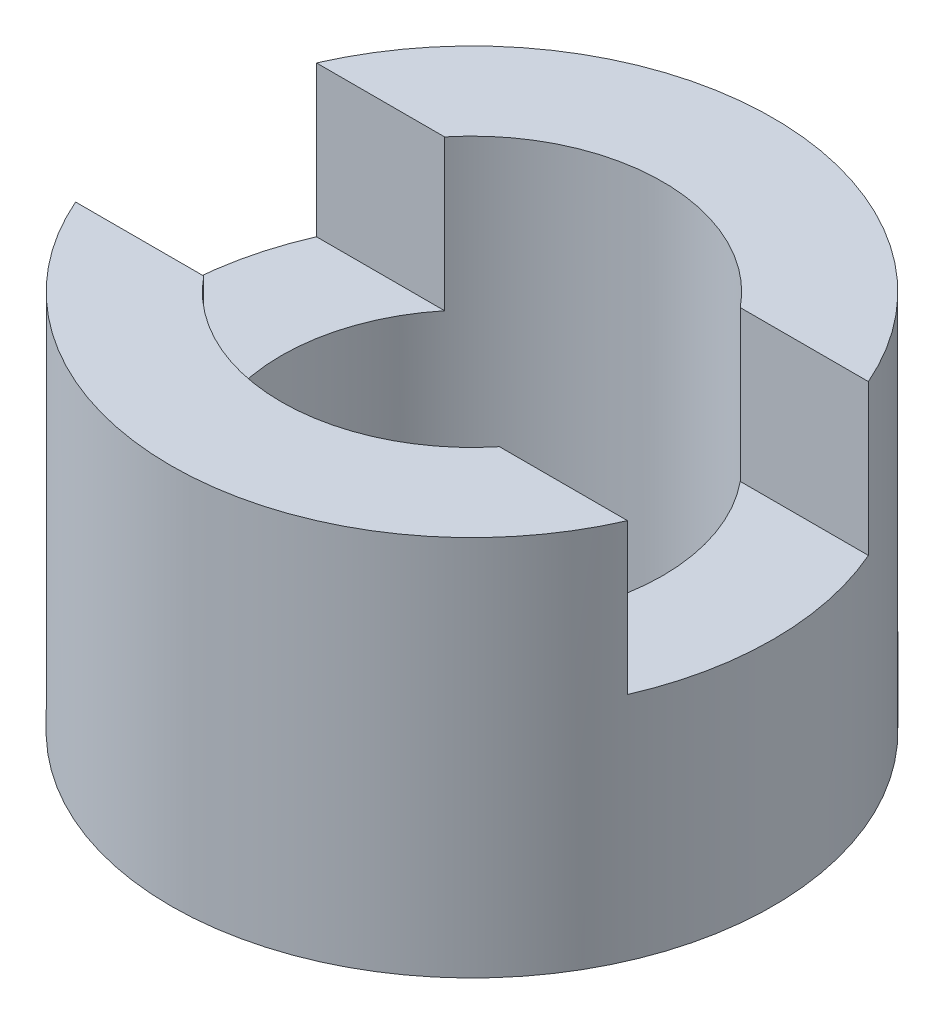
ISO-10303-21;
HEADER;
FILE_DESCRIPTION(('STEP AP214'),'2;1');
FILE_NAME('part.step','',(''),(''),'','','');
FILE_SCHEMA(('AUTOMOTIVE_DESIGN { 1 0 10303 214 1 1 1 1 }'));
ENDSEC;
DATA;
#1=APPLICATION_CONTEXT('core data for automotive mechanical design processes');
#2=APPLICATION_PROTOCOL_DEFINITION('international standard','automotive_design',2000,#1);
#3=PRODUCT_CONTEXT('',#1,'mechanical');
#4=PRODUCT('Part','Part','',(#3));
#5=PRODUCT_RELATED_PRODUCT_CATEGORY('part','',(#4));
#6=PRODUCT_DEFINITION_FORMATION('','',#4);
#7=PRODUCT_DEFINITION_CONTEXT('part definition',#1,'design');
#8=PRODUCT_DEFINITION('design','',#6,#7);
#9=PRODUCT_DEFINITION_SHAPE('','',#8);
#10=(LENGTH_UNIT() NAMED_UNIT(*) SI_UNIT(.MILLI.,.METRE.));
#11=(NAMED_UNIT(*) PLANE_ANGLE_UNIT() SI_UNIT($,.RADIAN.));
#12=(NAMED_UNIT(*) SI_UNIT($,.STERADIAN.) SOLID_ANGLE_UNIT());
#13=UNCERTAINTY_MEASURE_WITH_UNIT(LENGTH_MEASURE(1.E-05),#10,'distance_accuracy_value','');
#14=(GEOMETRIC_REPRESENTATION_CONTEXT(3) GLOBAL_UNCERTAINTY_ASSIGNED_CONTEXT((#13)) GLOBAL_UNIT_ASSIGNED_CONTEXT((#10,
#11,#12)) REPRESENTATION_CONTEXT('',''));
#15=CARTESIAN_POINT('',(0.,0.,0.));
#16=DIRECTION('',(0.,0.,1.));
#17=DIRECTION('',(1.,0.,0.));
#18=AXIS2_PLACEMENT_3D('',#15,#16,#17);
#19=CARTESIAN_POINT('',(19.,38.,0.));
#20=DIRECTION('',(0.,-1.,0.));
#21=DIRECTION('',(0.,0.,-1.));
#22=AXIS2_PLACEMENT_3D('',#19,#20,#21);
#23=PLANE('',#22);
#24=CARTESIAN_POINT('',(0.,38.,0.));
#25=DIRECTION('',(0.,1.,0.));
#26=DIRECTION('',(0.,0.,1.));
#27=AXIS2_PLACEMENT_3D('',#24,#25,#26);
#28=CIRCLE('',#27,30.);
#29=CARTESIAN_POINT('',(-27.495454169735,38.,12.));
#30=VERTEX_POINT('',#29);
#31=CARTESIAN_POINT('',(27.495454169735,38.,12.));
#32=VERTEX_POINT('',#31);
#33=EDGE_CURVE('E112',#30,#32,#28,.T.);
#34=ORIENTED_EDGE('',*,*,#33,.T.);
#35=DIRECTION('',(-1.,0.,0.));
#36=VECTOR('',#35,1.);
#37=CARTESIAN_POINT('',(19.,38.,12.));
#38=LINE('',#37,#36);
#39=CARTESIAN_POINT('',(14.7309198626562,38.,12.));
#40=VERTEX_POINT('',#39);
#41=EDGE_CURVE('E113',#32,#40,#38,.T.);
#42=ORIENTED_EDGE('',*,*,#41,.T.);
#43=CARTESIAN_POINT('',(0.,38.,0.));
#44=DIRECTION('',(0.,1.,0.));
#45=DIRECTION('',(0.,0.,1.));
#46=AXIS2_PLACEMENT_3D('',#43,#44,#45);
#47=CIRCLE('',#46,19.);
#48=CARTESIAN_POINT('',(-14.7309198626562,38.,12.));
#49=VERTEX_POINT('',#48);
#50=EDGE_CURVE('E126',#49,#40,#47,.T.);
#51=ORIENTED_EDGE('',*,*,#50,.F.);
#52=EDGE_CURVE('E114',#49,#30,#38,.T.);
#53=ORIENTED_EDGE('',*,*,#52,.T.);
#54=EDGE_LOOP('',(#34,#42,#51,#53));
#55=FACE_BOUND('',#54,.T.);
#56=ADVANCED_FACE('F26',(#55),#23,.F.);
#57=CARTESIAN_POINT('',(30.,0.,0.));
#58=DIRECTION('',(0.,1.,0.));
#59=DIRECTION('',(0.,0.,1.));
#60=AXIS2_PLACEMENT_3D('',#57,#58,#59);
#61=PLANE('',#60);
#62=CARTESIAN_POINT('',(0.,0.,0.));
#63=DIRECTION('',(0.,1.,0.));
#64=DIRECTION('',(0.,0.,1.));
#65=AXIS2_PLACEMENT_3D('',#62,#63,#64);
#66=CIRCLE('',#65,30.);
#67=CARTESIAN_POINT('',(0.,0.,30.));
#68=VERTEX_POINT('',#67);
#69=EDGE_CURVE('E132',#68,#68,#66,.T.);
#70=ORIENTED_EDGE('',*,*,#69,.F.);
#71=EDGE_LOOP('',(#70));
#72=FACE_BOUND('',#71,.T.);
#73=CARTESIAN_POINT('',(0.,0.,0.));
#74=DIRECTION('',(0.,1.,0.));
#75=DIRECTION('',(0.,0.,1.));
#76=AXIS2_PLACEMENT_3D('',#73,#74,#75);
#77=CIRCLE('',#76,19.);
#78=CARTESIAN_POINT('',(0.,0.,19.));
#79=VERTEX_POINT('',#78);
#80=EDGE_CURVE('E123',#79,#79,#77,.T.);
#81=ORIENTED_EDGE('',*,*,#80,.T.);
#82=EDGE_LOOP('',(#81));
#83=FACE_BOUND('',#82,.T.);
#84=ADVANCED_FACE('F28',(#72,#83),#61,.F.);
#85=CARTESIAN_POINT('',(0.,46.1769874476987,0.));
#86=DIRECTION('',(0.,1.,0.));
#87=DIRECTION('',(0.,0.,1.));
#88=AXIS2_PLACEMENT_3D('',#85,#86,#87);
#89=CYLINDRICAL_SURFACE('',#88,30.);
#90=CARTESIAN_POINT('',(0.,23.,0.));
#91=DIRECTION('',(0.,-1.,0.));
#92=DIRECTION('',(0.,0.,-1.));
#93=AXIS2_PLACEMENT_3D('',#90,#91,#92);
#94=CIRCLE('',#93,30.);
#95=CARTESIAN_POINT('',(27.495454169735,23.,-12.));
#96=VERTEX_POINT('',#95);
#97=CARTESIAN_POINT('',(27.495454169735,23.,12.));
#98=VERTEX_POINT('',#97);
#99=EDGE_CURVE('E97',#96,#98,#94,.T.);
#100=ORIENTED_EDGE('',*,*,#99,.T.);
#101=DIRECTION('',(0.,1.,0.));
#102=VECTOR('',#101,1.);
#103=CARTESIAN_POINT('',(27.495454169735,46.1769874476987,12.));
#104=LINE('',#103,#102);
#105=EDGE_CURVE('E117',#98,#32,#104,.T.);
#106=ORIENTED_EDGE('',*,*,#105,.T.);
#107=ORIENTED_EDGE('',*,*,#33,.F.);
#108=DIRECTION('',(0.,1.,0.));
#109=VECTOR('',#108,1.);
#110=CARTESIAN_POINT('',(-27.495454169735,46.1769874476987,12.));
#111=LINE('',#110,#109);
#112=CARTESIAN_POINT('',(-27.495454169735,23.,12.));
#113=VERTEX_POINT('',#112);
#114=EDGE_CURVE('E101',#30,#113,#111,.F.);
#115=ORIENTED_EDGE('',*,*,#114,.T.);
#116=CARTESIAN_POINT('',(-27.495454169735,23.,-12.));
#117=VERTEX_POINT('',#116);
#118=EDGE_CURVE('E90',#113,#117,#94,.T.);
#119=ORIENTED_EDGE('',*,*,#118,.T.);
#120=DIRECTION('',(0.,1.,0.));
#121=VECTOR('',#120,1.);
#122=CARTESIAN_POINT('',(-27.495454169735,46.1769874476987,-12.));
#123=LINE('',#122,#121);
#124=CARTESIAN_POINT('',(-27.495454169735,38.,-12.));
#125=VERTEX_POINT('',#124);
#126=EDGE_CURVE('E119',#117,#125,#123,.T.);
#127=ORIENTED_EDGE('',*,*,#126,.T.);
#128=CARTESIAN_POINT('',(27.495454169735,38.,-12.));
#129=VERTEX_POINT('',#128);
#130=EDGE_CURVE('E131',#129,#125,#28,.T.);
#131=ORIENTED_EDGE('',*,*,#130,.F.);
#132=DIRECTION('',(0.,1.,0.));
#133=VECTOR('',#132,1.);
#134=CARTESIAN_POINT('',(27.495454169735,46.1769874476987,-12.));
#135=LINE('',#134,#133);
#136=EDGE_CURVE('E159',#129,#96,#135,.F.);
#137=ORIENTED_EDGE('',*,*,#136,.T.);
#138=EDGE_LOOP('',(#100,#106,#107,#115,#119,#127,#131,#137));
#139=FACE_BOUND('',#138,.T.);
#140=ORIENTED_EDGE('',*,*,#69,.T.);
#141=EDGE_LOOP('',(#140));
#142=FACE_BOUND('',#141,.T.);
#143=ADVANCED_FACE('F108',(#139,#142),#89,.T.);
#144=ORIENTED_EDGE('',*,*,#130,.T.);
#145=DIRECTION('',(1.,0.,0.));
#146=VECTOR('',#145,1.);
#147=CARTESIAN_POINT('',(19.,38.,-12.));
#148=LINE('',#147,#146);
#149=CARTESIAN_POINT('',(-14.7309198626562,38.,-12.));
#150=VERTEX_POINT('',#149);
#151=EDGE_CURVE('E160',#125,#150,#148,.T.);
#152=ORIENTED_EDGE('',*,*,#151,.T.);
#153=CARTESIAN_POINT('',(14.7309198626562,38.,-12.));
#154=VERTEX_POINT('',#153);
#155=EDGE_CURVE('E129',#154,#150,#47,.T.);
#156=ORIENTED_EDGE('',*,*,#155,.F.);
#157=EDGE_CURVE('E156',#154,#129,#148,.T.);
#158=ORIENTED_EDGE('',*,*,#157,.T.);
#159=EDGE_LOOP('',(#144,#152,#156,#158));
#160=FACE_BOUND('',#159,.T.);
#161=ADVANCED_FACE('F166',(#160),#23,.F.);
#162=CARTESIAN_POINT('',(0.,46.1769874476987,0.));
#163=DIRECTION('',(0.,1.,0.));
#164=DIRECTION('',(0.,0.,1.));
#165=AXIS2_PLACEMENT_3D('',#162,#163,#164);
#166=CYLINDRICAL_SURFACE('',#165,19.);
#167=CARTESIAN_POINT('',(0.,23.,0.));
#168=DIRECTION('',(0.,-1.,0.));
#169=DIRECTION('',(0.,0.,-1.));
#170=AXIS2_PLACEMENT_3D('',#167,#168,#169);
#171=CIRCLE('',#170,19.);
#172=CARTESIAN_POINT('',(-14.7309198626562,23.,-12.));
#173=VERTEX_POINT('',#172);
#174=CARTESIAN_POINT('',(-14.7309198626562,23.,12.));
#175=VERTEX_POINT('',#174);
#176=EDGE_CURVE('E139',#173,#175,#171,.F.);
#177=ORIENTED_EDGE('',*,*,#176,.T.);
#178=DIRECTION('',(0.,1.,0.));
#179=VECTOR('',#178,1.);
#180=CARTESIAN_POINT('',(-14.7309198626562,46.1769874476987,12.));
#181=LINE('',#180,#179);
#182=EDGE_CURVE('E11',#175,#49,#181,.T.);
#183=ORIENTED_EDGE('',*,*,#182,.T.);
#184=ORIENTED_EDGE('',*,*,#50,.T.);
#185=DIRECTION('',(0.,1.,0.));
#186=VECTOR('',#185,1.);
#187=CARTESIAN_POINT('',(14.7309198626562,46.1769874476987,12.));
#188=LINE('',#187,#186);
#189=CARTESIAN_POINT('',(14.7309198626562,23.,12.));
#190=VERTEX_POINT('',#189);
#191=EDGE_CURVE('E142',#40,#190,#188,.F.);
#192=ORIENTED_EDGE('',*,*,#191,.T.);
#193=CARTESIAN_POINT('',(14.7309198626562,23.,-12.));
#194=VERTEX_POINT('',#193);
#195=EDGE_CURVE('E135',#190,#194,#171,.F.);
#196=ORIENTED_EDGE('',*,*,#195,.T.);
#197=DIRECTION('',(0.,1.,0.));
#198=VECTOR('',#197,1.);
#199=CARTESIAN_POINT('',(14.7309198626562,46.1769874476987,-12.));
#200=LINE('',#199,#198);
#201=EDGE_CURVE('E138',#194,#154,#200,.T.);
#202=ORIENTED_EDGE('',*,*,#201,.T.);
#203=ORIENTED_EDGE('',*,*,#155,.T.);
#204=DIRECTION('',(0.,1.,0.));
#205=VECTOR('',#204,1.);
#206=CARTESIAN_POINT('',(-14.7309198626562,46.1769874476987,-12.));
#207=LINE('',#206,#205);
#208=EDGE_CURVE('E34',#150,#173,#207,.F.);
#209=ORIENTED_EDGE('',*,*,#208,.T.);
#210=EDGE_LOOP('',(#177,#183,#184,#192,#196,#202,#203,#209));
#211=FACE_BOUND('',#210,.T.);
#212=ORIENTED_EDGE('',*,*,#80,.F.);
#213=EDGE_LOOP('',(#212));
#214=FACE_BOUND('',#213,.T.);
#215=ADVANCED_FACE('F147',(#211,#214),#166,.F.);
#216=CARTESIAN_POINT('',(-40.,23.,12.));
#217=DIRECTION('',(0.,-1.,0.));
#218=DIRECTION('',(0.,0.,-1.));
#219=AXIS2_PLACEMENT_3D('',#216,#217,#218);
#220=PLANE('',#219);
#221=DIRECTION('',(1.,0.,0.));
#222=VECTOR('',#221,1.);
#223=CARTESIAN_POINT('',(-40.,23.,-12.));
#224=LINE('',#223,#222);
#225=EDGE_CURVE('E49',#194,#96,#224,.T.);
#226=ORIENTED_EDGE('',*,*,#225,.F.);
#227=ORIENTED_EDGE('',*,*,#195,.F.);
#228=DIRECTION('',(1.,0.,0.));
#229=VECTOR('',#228,1.);
#230=CARTESIAN_POINT('',(-40.,23.,12.));
#231=LINE('',#230,#229);
#232=EDGE_CURVE('E104',#190,#98,#231,.T.);
#233=ORIENTED_EDGE('',*,*,#232,.T.);
#234=ORIENTED_EDGE('',*,*,#99,.F.);
#235=EDGE_LOOP('',(#226,#227,#233,#234));
#236=FACE_BOUND('',#235,.T.);
#237=ADVANCED_FACE('F169',(#236),#220,.F.);
#238=CARTESIAN_POINT('',(-40.,38.5276615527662,-12.));
#239=DIRECTION('',(0.,0.,-1.));
#240=DIRECTION('',(0.,1.,0.));
#241=AXIS2_PLACEMENT_3D('',#238,#239,#240);
#242=PLANE('',#241);
#243=ORIENTED_EDGE('',*,*,#157,.F.);
#244=ORIENTED_EDGE('',*,*,#201,.F.);
#245=ORIENTED_EDGE('',*,*,#225,.T.);
#246=ORIENTED_EDGE('',*,*,#136,.F.);
#247=EDGE_LOOP('',(#243,#244,#245,#246));
#248=FACE_BOUND('',#247,.T.);
#249=ADVANCED_FACE('F168',(#248),#242,.F.);
#250=CARTESIAN_POINT('',(-40.,38.5276615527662,12.));
#251=DIRECTION('',(0.,0.,1.));
#252=DIRECTION('',(0.,-1.,0.));
#253=AXIS2_PLACEMENT_3D('',#250,#251,#252);
#254=PLANE('',#253);
#255=ORIENTED_EDGE('',*,*,#232,.F.);
#256=ORIENTED_EDGE('',*,*,#191,.F.);
#257=ORIENTED_EDGE('',*,*,#41,.F.);
#258=ORIENTED_EDGE('',*,*,#105,.F.);
#259=EDGE_LOOP('',(#255,#256,#257,#258));
#260=FACE_BOUND('',#259,.T.);
#261=ADVANCED_FACE('F172',(#260),#254,.F.);
#262=ORIENTED_EDGE('',*,*,#52,.F.);
#263=ORIENTED_EDGE('',*,*,#182,.F.);
#264=EDGE_CURVE('E41',#113,#175,#231,.T.);
#265=ORIENTED_EDGE('',*,*,#264,.F.);
#266=ORIENTED_EDGE('',*,*,#114,.F.);
#267=EDGE_LOOP('',(#262,#263,#265,#266));
#268=FACE_BOUND('',#267,.T.);
#269=ADVANCED_FACE('F100',(#268),#254,.F.);
#270=EDGE_CURVE('E93',#117,#173,#224,.T.);
#271=ORIENTED_EDGE('',*,*,#270,.T.);
#272=ORIENTED_EDGE('',*,*,#208,.F.);
#273=ORIENTED_EDGE('',*,*,#151,.F.);
#274=ORIENTED_EDGE('',*,*,#126,.F.);
#275=EDGE_LOOP('',(#271,#272,#273,#274));
#276=FACE_BOUND('',#275,.T.);
#277=ADVANCED_FACE('F151',(#276),#242,.F.);
#278=ORIENTED_EDGE('',*,*,#264,.T.);
#279=ORIENTED_EDGE('',*,*,#176,.F.);
#280=ORIENTED_EDGE('',*,*,#270,.F.);
#281=ORIENTED_EDGE('',*,*,#118,.F.);
#282=EDGE_LOOP('',(#278,#279,#280,#281));
#283=FACE_BOUND('',#282,.T.);
#284=ADVANCED_FACE('F91',(#283),#220,.F.);
#285=CLOSED_SHELL('',(#56,#84,#143,#161,#215,#237,#249,#261,#269,#277,#284));
#286=MANIFOLD_SOLID_BREP('B2',#285);
#287=ADVANCED_BREP_SHAPE_REPRESENTATION('',(#18,#286),#14);
#288=SHAPE_DEFINITION_REPRESENTATION(#9,#287);
ENDSEC;
END-ISO-10303-21;
